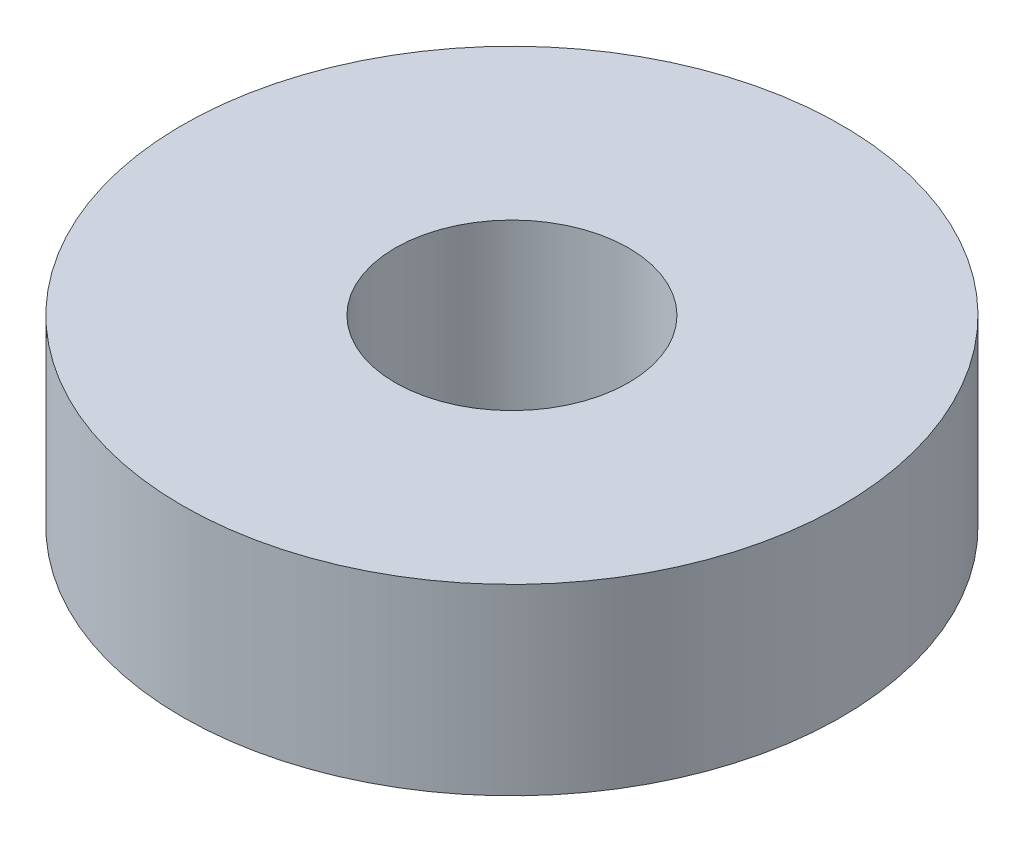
ISO-10303-21;
HEADER;
FILE_DESCRIPTION(('STEP AP214'),'2;1');
FILE_NAME('part.step','',(''),(''),'','','');
FILE_SCHEMA(('AUTOMOTIVE_DESIGN { 1 0 10303 214 1 1 1 1 }'));
ENDSEC;
DATA;
#1=APPLICATION_CONTEXT('core data for automotive mechanical design processes');
#2=APPLICATION_PROTOCOL_DEFINITION('international standard','automotive_design',2000,#1);
#3=PRODUCT_CONTEXT('',#1,'mechanical');
#4=PRODUCT('Part','Part','',(#3));
#5=PRODUCT_RELATED_PRODUCT_CATEGORY('part','',(#4));
#6=PRODUCT_DEFINITION_FORMATION('','',#4);
#7=PRODUCT_DEFINITION_CONTEXT('part definition',#1,'design');
#8=PRODUCT_DEFINITION('design','',#6,#7);
#9=PRODUCT_DEFINITION_SHAPE('','',#8);
#10=(LENGTH_UNIT() NAMED_UNIT(*) SI_UNIT(.MILLI.,.METRE.));
#11=(NAMED_UNIT(*) PLANE_ANGLE_UNIT() SI_UNIT($,.RADIAN.));
#12=(NAMED_UNIT(*) SI_UNIT($,.STERADIAN.) SOLID_ANGLE_UNIT());
#13=UNCERTAINTY_MEASURE_WITH_UNIT(LENGTH_MEASURE(1.E-05),#10,'distance_accuracy_value','');
#14=(GEOMETRIC_REPRESENTATION_CONTEXT(3) GLOBAL_UNCERTAINTY_ASSIGNED_CONTEXT((#13)) GLOBAL_UNIT_ASSIGNED_CONTEXT((#10,
#11,#12)) REPRESENTATION_CONTEXT('',''));
#15=CARTESIAN_POINT('',(0.,0.,0.));
#16=DIRECTION('',(0.,0.,1.));
#17=DIRECTION('',(1.,0.,0.));
#18=AXIS2_PLACEMENT_3D('',#15,#16,#17);
#19=CARTESIAN_POINT('',(0.,5.08,0.));
#20=DIRECTION('',(0.,1.,0.));
#21=DIRECTION('',(0.,0.,1.));
#22=AXIS2_PLACEMENT_3D('',#19,#20,#21);
#23=PLANE('',#22);
#24=CARTESIAN_POINT('',(0.,5.08,0.));
#25=DIRECTION('',(0.,1.,0.));
#26=DIRECTION('',(0.,0.,1.));
#27=AXIS2_PLACEMENT_3D('',#24,#25,#26);
#28=CIRCLE('',#27,9.144);
#29=CARTESIAN_POINT('',(0.,5.08,9.144));
#30=VERTEX_POINT('',#29);
#31=EDGE_CURVE('E10',#30,#30,#28,.T.);
#32=ORIENTED_EDGE('',*,*,#31,.T.);
#33=EDGE_LOOP('',(#32));
#34=FACE_BOUND('',#33,.T.);
#35=CARTESIAN_POINT('',(0.,5.08,0.));
#36=DIRECTION('',(0.,1.,0.));
#37=DIRECTION('',(0.,0.,1.));
#38=AXIS2_PLACEMENT_3D('',#35,#36,#37);
#39=CIRCLE('',#38,3.2385);
#40=CARTESIAN_POINT('',(0.,5.08,3.2385));
#41=VERTEX_POINT('',#40);
#42=EDGE_CURVE('E42',#41,#41,#39,.T.);
#43=ORIENTED_EDGE('',*,*,#42,.F.);
#44=EDGE_LOOP('',(#43));
#45=FACE_BOUND('',#44,.T.);
#46=ADVANCED_FACE('F31',(#34,#45),#23,.T.);
#47=CARTESIAN_POINT('',(0.,0.,0.));
#48=DIRECTION('',(0.,1.,0.));
#49=DIRECTION('',(0.,0.,1.));
#50=AXIS2_PLACEMENT_3D('',#47,#48,#49);
#51=PLANE('',#50);
#52=CARTESIAN_POINT('',(0.,0.,0.));
#53=DIRECTION('',(0.,1.,0.));
#54=DIRECTION('',(0.,0.,1.));
#55=AXIS2_PLACEMENT_3D('',#52,#53,#54);
#56=CIRCLE('',#55,9.144);
#57=CARTESIAN_POINT('',(0.,0.,9.144));
#58=VERTEX_POINT('',#57);
#59=EDGE_CURVE('E35',#58,#58,#56,.T.);
#60=ORIENTED_EDGE('',*,*,#59,.F.);
#61=EDGE_LOOP('',(#60));
#62=FACE_BOUND('',#61,.T.);
#63=CARTESIAN_POINT('',(0.,0.,0.));
#64=DIRECTION('',(0.,1.,0.));
#65=DIRECTION('',(0.,0.,1.));
#66=AXIS2_PLACEMENT_3D('',#63,#64,#65);
#67=CIRCLE('',#66,3.2385);
#68=CARTESIAN_POINT('',(0.,0.,3.2385));
#69=VERTEX_POINT('',#68);
#70=EDGE_CURVE('E44',#69,#69,#67,.T.);
#71=ORIENTED_EDGE('',*,*,#70,.T.);
#72=EDGE_LOOP('',(#71));
#73=FACE_BOUND('',#72,.T.);
#74=ADVANCED_FACE('F54',(#62,#73),#51,.F.);
#75=CARTESIAN_POINT('',(0.,5.08,0.));
#76=DIRECTION('',(0.,-1.,0.));
#77=DIRECTION('',(0.,0.,-1.));
#78=AXIS2_PLACEMENT_3D('',#75,#76,#77);
#79=CYLINDRICAL_SURFACE('',#78,9.144);
#80=ORIENTED_EDGE('',*,*,#31,.F.);
#81=EDGE_LOOP('',(#80));
#82=FACE_BOUND('',#81,.T.);
#83=ORIENTED_EDGE('',*,*,#59,.T.);
#84=EDGE_LOOP('',(#83));
#85=FACE_BOUND('',#84,.T.);
#86=ADVANCED_FACE('F33',(#82,#85),#79,.T.);
#87=CARTESIAN_POINT('',(0.,5.08,0.));
#88=DIRECTION('',(0.,-1.,0.));
#89=DIRECTION('',(0.,0.,-1.));
#90=AXIS2_PLACEMENT_3D('',#87,#88,#89);
#91=CYLINDRICAL_SURFACE('',#90,3.2385);
#92=ORIENTED_EDGE('',*,*,#42,.T.);
#93=EDGE_LOOP('',(#92));
#94=FACE_BOUND('',#93,.T.);
#95=ORIENTED_EDGE('',*,*,#70,.F.);
#96=EDGE_LOOP('',(#95));
#97=FACE_BOUND('',#96,.T.);
#98=ADVANCED_FACE('F50',(#94,#97),#91,.F.);
#99=CLOSED_SHELL('',(#46,#74,#86,#98));
#100=MANIFOLD_SOLID_BREP('B2',#99);
#101=ADVANCED_BREP_SHAPE_REPRESENTATION('',(#18,#100),#14);
#102=SHAPE_DEFINITION_REPRESENTATION(#9,#101);
ENDSEC;
END-ISO-10303-21;
